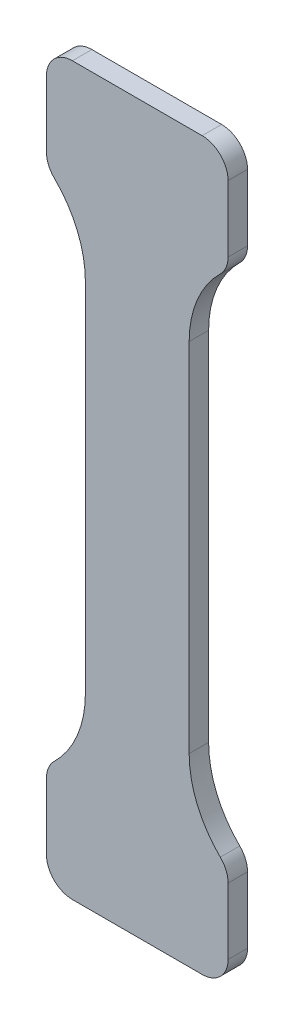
ISO-10303-21;
HEADER;
FILE_DESCRIPTION(('STEP AP214'),'2;1');
FILE_NAME('part.step','',(''),(''),'','','');
FILE_SCHEMA(('AUTOMOTIVE_DESIGN { 1 0 10303 214 1 1 1 1 }'));
ENDSEC;
DATA;
#1=APPLICATION_CONTEXT('core data for automotive mechanical design processes');
#2=APPLICATION_PROTOCOL_DEFINITION('international standard','automotive_design',2000,#1);
#3=PRODUCT_CONTEXT('',#1,'mechanical');
#4=PRODUCT('Part','Part','',(#3));
#5=PRODUCT_RELATED_PRODUCT_CATEGORY('part','',(#4));
#6=PRODUCT_DEFINITION_FORMATION('','',#4);
#7=PRODUCT_DEFINITION_CONTEXT('part definition',#1,'design');
#8=PRODUCT_DEFINITION('design','',#6,#7);
#9=PRODUCT_DEFINITION_SHAPE('','',#8);
#10=(LENGTH_UNIT() NAMED_UNIT(*) SI_UNIT(.MILLI.,.METRE.));
#11=(NAMED_UNIT(*) PLANE_ANGLE_UNIT() SI_UNIT($,.RADIAN.));
#12=(NAMED_UNIT(*) SI_UNIT($,.STERADIAN.) SOLID_ANGLE_UNIT());
#13=UNCERTAINTY_MEASURE_WITH_UNIT(LENGTH_MEASURE(1.E-05),#10,'distance_accuracy_value','');
#14=(GEOMETRIC_REPRESENTATION_CONTEXT(3) GLOBAL_UNCERTAINTY_ASSIGNED_CONTEXT((#13)) GLOBAL_UNIT_ASSIGNED_CONTEXT((#10,
#11,#12)) REPRESENTATION_CONTEXT('',''));
#15=CARTESIAN_POINT('',(0.,0.,0.));
#16=DIRECTION('',(0.,0.,1.));
#17=DIRECTION('',(1.,0.,0.));
#18=AXIS2_PLACEMENT_3D('',#15,#16,#17);
#19=CARTESIAN_POINT('',(-4.,20.,1.5));
#20=DIRECTION('',(1.,0.,0.));
#21=DIRECTION('',(0.,0.,-1.));
#22=AXIS2_PLACEMENT_3D('',#19,#20,#21);
#23=PLANE('',#22);
#24=DIRECTION('',(0.,-1.,0.));
#25=VECTOR('',#24,1.);
#26=CARTESIAN_POINT('',(-4.,20.,1.5));
#27=LINE('',#26,#25);
#28=CARTESIAN_POINT('',(-4.,13.7550020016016,1.5));
#29=VERTEX_POINT('',#28);
#30=CARTESIAN_POINT('',(-4.,-13.7550020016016,1.5));
#31=VERTEX_POINT('',#30);
#32=EDGE_CURVE('E194',#29,#31,#27,.T.);
#33=ORIENTED_EDGE('',*,*,#32,.F.);
#34=DIRECTION('',(0.,0.,-1.));
#35=VECTOR('',#34,1.);
#36=CARTESIAN_POINT('',(-4.,13.7550020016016,1.5));
#37=LINE('',#36,#35);
#38=CARTESIAN_POINT('',(-4.,13.7550020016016,0.));
#39=VERTEX_POINT('',#38);
#40=EDGE_CURVE('E180',#29,#39,#37,.T.);
#41=ORIENTED_EDGE('',*,*,#40,.T.);
#42=DIRECTION('',(0.,-1.,0.));
#43=VECTOR('',#42,1.);
#44=CARTESIAN_POINT('',(-4.,20.,0.));
#45=LINE('',#44,#43);
#46=CARTESIAN_POINT('',(-4.,-13.7550020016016,0.));
#47=VERTEX_POINT('',#46);
#48=EDGE_CURVE('E191',#39,#47,#45,.T.);
#49=ORIENTED_EDGE('',*,*,#48,.T.);
#50=DIRECTION('',(0.,0.,1.));
#51=VECTOR('',#50,1.);
#52=CARTESIAN_POINT('',(-4.,-13.7550020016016,1.5));
#53=LINE('',#52,#51);
#54=EDGE_CURVE('E196',#47,#31,#53,.T.);
#55=ORIENTED_EDGE('',*,*,#54,.T.);
#56=EDGE_LOOP('',(#33,#41,#49,#55));
#57=FACE_BOUND('',#56,.T.);
#58=ADVANCED_FACE('F37',(#57),#23,.F.);
#59=CARTESIAN_POINT('',(-7.,-20.,1.5));
#60=DIRECTION('',(1.,0.,0.));
#61=DIRECTION('',(0.,0.,-1.));
#62=AXIS2_PLACEMENT_3D('',#59,#60,#61);
#63=PLANE('',#62);
#64=DIRECTION('',(0.,-1.,0.));
#65=VECTOR('',#64,1.);
#66=CARTESIAN_POINT('',(-7.,-20.,1.5));
#67=LINE('',#66,#65);
#68=CARTESIAN_POINT('',(-7.,-20.8964304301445,1.5));
#69=VERTEX_POINT('',#68);
#70=CARTESIAN_POINT('',(-7.,-26.,1.5));
#71=VERTEX_POINT('',#70);
#72=EDGE_CURVE('E337',#69,#71,#67,.T.);
#73=ORIENTED_EDGE('',*,*,#72,.F.);
#74=DIRECTION('',(0.,0.,1.));
#75=VECTOR('',#74,1.);
#76=CARTESIAN_POINT('',(-7.,-20.8964304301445,1.5));
#77=LINE('',#76,#75);
#78=CARTESIAN_POINT('',(-7.,-20.8964304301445,0.));
#79=VERTEX_POINT('',#78);
#80=EDGE_CURVE('E289',#69,#79,#77,.F.);
#81=ORIENTED_EDGE('',*,*,#80,.T.);
#82=DIRECTION('',(0.,-1.,0.));
#83=VECTOR('',#82,1.);
#84=CARTESIAN_POINT('',(-7.,-20.,0.));
#85=LINE('',#84,#83);
#86=CARTESIAN_POINT('',(-7.,-26.,0.));
#87=VERTEX_POINT('',#86);
#88=EDGE_CURVE('E202',#79,#87,#85,.T.);
#89=ORIENTED_EDGE('',*,*,#88,.T.);
#90=DIRECTION('',(0.,0.,-1.));
#91=VECTOR('',#90,1.);
#92=CARTESIAN_POINT('',(-7.,-26.,1.5));
#93=LINE('',#92,#91);
#94=EDGE_CURVE('E287',#87,#71,#93,.F.);
#95=ORIENTED_EDGE('',*,*,#94,.T.);
#96=EDGE_LOOP('',(#73,#81,#89,#95));
#97=FACE_BOUND('',#96,.T.);
#98=ADVANCED_FACE('F352',(#97),#63,.F.);
#99=CARTESIAN_POINT('',(-7.,-28.,1.5));
#100=DIRECTION('',(0.,1.,0.));
#101=DIRECTION('',(0.,0.,1.));
#102=AXIS2_PLACEMENT_3D('',#99,#100,#101);
#103=PLANE('',#102);
#104=DIRECTION('',(1.,0.,0.));
#105=VECTOR('',#104,1.);
#106=CARTESIAN_POINT('',(-7.,-28.,1.5));
#107=LINE('',#106,#105);
#108=CARTESIAN_POINT('',(-5.,-28.,1.5));
#109=VERTEX_POINT('',#108);
#110=CARTESIAN_POINT('',(5.,-28.,1.5));
#111=VERTEX_POINT('',#110);
#112=EDGE_CURVE('E334',#109,#111,#107,.T.);
#113=ORIENTED_EDGE('',*,*,#112,.F.);
#114=DIRECTION('',(0.,0.,-1.));
#115=VECTOR('',#114,1.);
#116=CARTESIAN_POINT('',(-5.,-28.,1.5));
#117=LINE('',#116,#115);
#118=CARTESIAN_POINT('',(-5.,-28.,0.));
#119=VERTEX_POINT('',#118);
#120=EDGE_CURVE('E296',#109,#119,#117,.T.);
#121=ORIENTED_EDGE('',*,*,#120,.T.);
#122=DIRECTION('',(1.,0.,0.));
#123=VECTOR('',#122,1.);
#124=CARTESIAN_POINT('',(-7.,-28.,0.));
#125=LINE('',#124,#123);
#126=CARTESIAN_POINT('',(5.,-28.,0.));
#127=VERTEX_POINT('',#126);
#128=EDGE_CURVE('E205',#119,#127,#125,.T.);
#129=ORIENTED_EDGE('',*,*,#128,.T.);
#130=DIRECTION('',(0.,0.,-1.));
#131=VECTOR('',#130,1.);
#132=CARTESIAN_POINT('',(5.,-28.,1.5));
#133=LINE('',#132,#131);
#134=EDGE_CURVE('E294',#127,#111,#133,.F.);
#135=ORIENTED_EDGE('',*,*,#134,.T.);
#136=EDGE_LOOP('',(#113,#121,#129,#135));
#137=FACE_BOUND('',#136,.T.);
#138=ADVANCED_FACE('F361',(#137),#103,.F.);
#139=CARTESIAN_POINT('',(7.,-20.,1.5));
#140=DIRECTION('',(-1.,0.,0.));
#141=DIRECTION('',(0.,-1.,0.));
#142=AXIS2_PLACEMENT_3D('',#139,#140,#141);
#143=PLANE('',#142);
#144=DIRECTION('',(0.,1.,0.));
#145=VECTOR('',#144,1.);
#146=CARTESIAN_POINT('',(7.,-20.,1.5));
#147=LINE('',#146,#145);
#148=CARTESIAN_POINT('',(7.,-26.,1.5));
#149=VERTEX_POINT('',#148);
#150=CARTESIAN_POINT('',(7.,-20.8964304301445,1.5));
#151=VERTEX_POINT('',#150);
#152=EDGE_CURVE('E331',#149,#151,#147,.T.);
#153=ORIENTED_EDGE('',*,*,#152,.F.);
#154=DIRECTION('',(0.,0.,-1.));
#155=VECTOR('',#154,1.);
#156=CARTESIAN_POINT('',(7.,-26.,1.5));
#157=LINE('',#156,#155);
#158=CARTESIAN_POINT('',(7.,-26.,0.));
#159=VERTEX_POINT('',#158);
#160=EDGE_CURVE('E301',#149,#159,#157,.T.);
#161=ORIENTED_EDGE('',*,*,#160,.T.);
#162=DIRECTION('',(0.,1.,0.));
#163=VECTOR('',#162,1.);
#164=CARTESIAN_POINT('',(7.,-20.,0.));
#165=LINE('',#164,#163);
#166=CARTESIAN_POINT('',(7.,-20.8964304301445,0.));
#167=VERTEX_POINT('',#166);
#168=EDGE_CURVE('E213',#159,#167,#165,.T.);
#169=ORIENTED_EDGE('',*,*,#168,.T.);
#170=DIRECTION('',(0.,0.,-1.));
#171=VECTOR('',#170,1.);
#172=CARTESIAN_POINT('',(7.,-20.8964304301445,1.5));
#173=LINE('',#172,#171);
#174=EDGE_CURVE('E299',#167,#151,#173,.F.);
#175=ORIENTED_EDGE('',*,*,#174,.T.);
#176=EDGE_LOOP('',(#153,#161,#169,#175));
#177=FACE_BOUND('',#176,.T.);
#178=ADVANCED_FACE('F370',(#177),#143,.F.);
#179=CARTESIAN_POINT('',(4.,20.,1.5));
#180=DIRECTION('',(-1.,0.,0.));
#181=DIRECTION('',(0.,-1.,0.));
#182=AXIS2_PLACEMENT_3D('',#179,#180,#181);
#183=PLANE('',#182);
#184=DIRECTION('',(0.,1.,0.));
#185=VECTOR('',#184,1.);
#186=CARTESIAN_POINT('',(4.,20.,0.));
#187=LINE('',#186,#185);
#188=CARTESIAN_POINT('',(4.,-13.7550020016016,0.));
#189=VERTEX_POINT('',#188);
#190=CARTESIAN_POINT('',(4.,13.7550020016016,0.));
#191=VERTEX_POINT('',#190);
#192=EDGE_CURVE('E216',#189,#191,#187,.T.);
#193=ORIENTED_EDGE('',*,*,#192,.T.);
#194=DIRECTION('',(0.,0.,1.));
#195=VECTOR('',#194,1.);
#196=CARTESIAN_POINT('',(4.,13.7550020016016,1.5));
#197=LINE('',#196,#195);
#198=CARTESIAN_POINT('',(4.,13.7550020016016,1.5));
#199=VERTEX_POINT('',#198);
#200=EDGE_CURVE('E186',#191,#199,#197,.T.);
#201=ORIENTED_EDGE('',*,*,#200,.T.);
#202=DIRECTION('',(0.,1.,0.));
#203=VECTOR('',#202,1.);
#204=CARTESIAN_POINT('',(4.,20.,1.5));
#205=LINE('',#204,#203);
#206=CARTESIAN_POINT('',(4.,-13.7550020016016,1.5));
#207=VERTEX_POINT('',#206);
#208=EDGE_CURVE('E326',#207,#199,#205,.T.);
#209=ORIENTED_EDGE('',*,*,#208,.F.);
#210=DIRECTION('',(0.,0.,-1.));
#211=VECTOR('',#210,1.);
#212=CARTESIAN_POINT('',(4.,-13.7550020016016,1.5));
#213=LINE('',#212,#211);
#214=EDGE_CURVE('E195',#207,#189,#213,.T.);
#215=ORIENTED_EDGE('',*,*,#214,.T.);
#216=EDGE_LOOP('',(#193,#201,#209,#215));
#217=FACE_BOUND('',#216,.T.);
#218=ADVANCED_FACE('F383',(#217),#183,.F.);
#219=CARTESIAN_POINT('',(7.,28.,1.5));
#220=DIRECTION('',(-1.,0.,0.));
#221=DIRECTION('',(0.,-1.,0.));
#222=AXIS2_PLACEMENT_3D('',#219,#220,#221);
#223=PLANE('',#222);
#224=DIRECTION('',(0.,1.,0.));
#225=VECTOR('',#224,1.);
#226=CARTESIAN_POINT('',(7.,28.,1.5));
#227=LINE('',#226,#225);
#228=CARTESIAN_POINT('',(7.,20.8964304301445,1.5));
#229=VERTEX_POINT('',#228);
#230=CARTESIAN_POINT('',(7.,26.,1.5));
#231=VERTEX_POINT('',#230);
#232=EDGE_CURVE('E311',#229,#231,#227,.T.);
#233=ORIENTED_EDGE('',*,*,#232,.F.);
#234=DIRECTION('',(0.,0.,1.));
#235=VECTOR('',#234,1.);
#236=CARTESIAN_POINT('',(7.,20.8964304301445,1.5));
#237=LINE('',#236,#235);
#238=CARTESIAN_POINT('',(7.,20.8964304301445,0.));
#239=VERTEX_POINT('',#238);
#240=EDGE_CURVE('E45',#229,#239,#237,.F.);
#241=ORIENTED_EDGE('',*,*,#240,.T.);
#242=DIRECTION('',(0.,1.,0.));
#243=VECTOR('',#242,1.);
#244=CARTESIAN_POINT('',(7.,28.,0.));
#245=LINE('',#244,#243);
#246=CARTESIAN_POINT('',(7.,26.,0.));
#247=VERTEX_POINT('',#246);
#248=EDGE_CURVE('E219',#239,#247,#245,.T.);
#249=ORIENTED_EDGE('',*,*,#248,.T.);
#250=DIRECTION('',(0.,0.,-1.));
#251=VECTOR('',#250,1.);
#252=CARTESIAN_POINT('',(7.,26.,1.5));
#253=LINE('',#252,#251);
#254=EDGE_CURVE('E52',#247,#231,#253,.F.);
#255=ORIENTED_EDGE('',*,*,#254,.T.);
#256=EDGE_LOOP('',(#233,#241,#249,#255));
#257=FACE_BOUND('',#256,.T.);
#258=ADVANCED_FACE('F310',(#257),#223,.F.);
#259=CARTESIAN_POINT('',(-7.,28.,1.5));
#260=DIRECTION('',(0.,-1.,0.));
#261=DIRECTION('',(1.,0.,0.));
#262=AXIS2_PLACEMENT_3D('',#259,#260,#261);
#263=PLANE('',#262);
#264=DIRECTION('',(-1.,0.,0.));
#265=VECTOR('',#264,1.);
#266=CARTESIAN_POINT('',(-7.,28.,0.));
#267=LINE('',#266,#265);
#268=CARTESIAN_POINT('',(5.,28.,0.));
#269=VERTEX_POINT('',#268);
#270=CARTESIAN_POINT('',(-5.,28.,0.));
#271=VERTEX_POINT('',#270);
#272=EDGE_CURVE('E221',#269,#271,#267,.T.);
#273=ORIENTED_EDGE('',*,*,#272,.T.);
#274=DIRECTION('',(0.,0.,-1.));
#275=VECTOR('',#274,1.);
#276=CARTESIAN_POINT('',(-5.,28.,1.5));
#277=LINE('',#276,#275);
#278=CARTESIAN_POINT('',(-5.,28.,1.5));
#279=VERTEX_POINT('',#278);
#280=EDGE_CURVE('E269',#271,#279,#277,.F.);
#281=ORIENTED_EDGE('',*,*,#280,.T.);
#282=DIRECTION('',(-1.,0.,0.));
#283=VECTOR('',#282,1.);
#284=CARTESIAN_POINT('',(-7.,28.,1.5));
#285=LINE('',#284,#283);
#286=CARTESIAN_POINT('',(5.,28.,1.5));
#287=VERTEX_POINT('',#286);
#288=EDGE_CURVE('E323',#287,#279,#285,.T.);
#289=ORIENTED_EDGE('',*,*,#288,.F.);
#290=DIRECTION('',(0.,0.,-1.));
#291=VECTOR('',#290,1.);
#292=CARTESIAN_POINT('',(5.,28.,1.5));
#293=LINE('',#292,#291);
#294=EDGE_CURVE('E266',#287,#269,#293,.T.);
#295=ORIENTED_EDGE('',*,*,#294,.T.);
#296=EDGE_LOOP('',(#273,#281,#289,#295));
#297=FACE_BOUND('',#296,.T.);
#298=ADVANCED_FACE('F320',(#297),#263,.F.);
#299=CARTESIAN_POINT('',(-7.,28.,1.5));
#300=DIRECTION('',(1.,0.,0.));
#301=DIRECTION('',(0.,0.,-1.));
#302=AXIS2_PLACEMENT_3D('',#299,#300,#301);
#303=PLANE('',#302);
#304=DIRECTION('',(0.,-1.,0.));
#305=VECTOR('',#304,1.);
#306=CARTESIAN_POINT('',(-7.,28.,1.5));
#307=LINE('',#306,#305);
#308=CARTESIAN_POINT('',(-7.,26.,1.5));
#309=VERTEX_POINT('',#308);
#310=CARTESIAN_POINT('',(-7.,20.8964304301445,1.5));
#311=VERTEX_POINT('',#310);
#312=EDGE_CURVE('E208',#309,#311,#307,.T.);
#313=ORIENTED_EDGE('',*,*,#312,.F.);
#314=DIRECTION('',(0.,0.,-1.));
#315=VECTOR('',#314,1.);
#316=CARTESIAN_POINT('',(-7.,26.,1.5));
#317=LINE('',#316,#315);
#318=CARTESIAN_POINT('',(-7.,26.,0.));
#319=VERTEX_POINT('',#318);
#320=EDGE_CURVE('E247',#309,#319,#317,.T.);
#321=ORIENTED_EDGE('',*,*,#320,.T.);
#322=DIRECTION('',(0.,-1.,0.));
#323=VECTOR('',#322,1.);
#324=CARTESIAN_POINT('',(-7.,28.,0.));
#325=LINE('',#324,#323);
#326=CARTESIAN_POINT('',(-7.,20.8964304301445,0.));
#327=VERTEX_POINT('',#326);
#328=EDGE_CURVE('E224',#319,#327,#325,.T.);
#329=ORIENTED_EDGE('',*,*,#328,.T.);
#330=DIRECTION('',(0.,0.,-1.));
#331=VECTOR('',#330,1.);
#332=CARTESIAN_POINT('',(-7.,20.8964304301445,1.5));
#333=LINE('',#332,#331);
#334=EDGE_CURVE('E245',#327,#311,#333,.F.);
#335=ORIENTED_EDGE('',*,*,#334,.T.);
#336=EDGE_LOOP('',(#313,#321,#329,#335));
#337=FACE_BOUND('',#336,.T.);
#338=ADVANCED_FACE('F501',(#337),#303,.F.);
#339=CARTESIAN_POINT('',(0.,0.,1.5));
#340=DIRECTION('',(0.,0.,-1.));
#341=DIRECTION('',(-1.,0.,0.));
#342=AXIS2_PLACEMENT_3D('',#339,#340,#341);
#343=PLANE('',#342);
#344=ORIENTED_EDGE('',*,*,#288,.T.);
#345=CARTESIAN_POINT('',(-5.,26.,1.5));
#346=DIRECTION('',(0.,0.,-1.));
#347=DIRECTION('',(-1.,0.,0.));
#348=AXIS2_PLACEMENT_3D('',#345,#346,#347);
#349=CIRCLE('',#348,2.);
#350=EDGE_CURVE('E284',#279,#309,#349,.F.);
#351=ORIENTED_EDGE('',*,*,#350,.T.);
#352=ORIENTED_EDGE('',*,*,#312,.T.);
#353=CARTESIAN_POINT('',(-5.,20.8964304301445,1.5));
#354=DIRECTION('',(0.,0.,-1.));
#355=DIRECTION('',(-1.,0.,0.));
#356=AXIS2_PLACEMENT_3D('',#353,#354,#355);
#357=CIRCLE('',#356,2.);
#358=CARTESIAN_POINT('',(-6.4,19.4681447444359,1.5));
#359=VERTEX_POINT('',#358);
#360=EDGE_CURVE('E282',#311,#359,#357,.F.);
#361=ORIENTED_EDGE('',*,*,#360,.T.);
#362=CARTESIAN_POINT('',(-12.,13.7550020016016,1.5));
#363=DIRECTION('',(0.,0.,-1.));
#364=DIRECTION('',(-1.,0.,0.));
#365=AXIS2_PLACEMENT_3D('',#362,#363,#364);
#366=CIRCLE('',#365,8.);
#367=EDGE_CURVE('E185',#359,#29,#366,.T.);
#368=ORIENTED_EDGE('',*,*,#367,.T.);
#369=ORIENTED_EDGE('',*,*,#32,.T.);
#370=CARTESIAN_POINT('',(-12.,-13.7550020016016,1.5));
#371=DIRECTION('',(0.,0.,-1.));
#372=DIRECTION('',(-1.,0.,0.));
#373=AXIS2_PLACEMENT_3D('',#370,#371,#372);
#374=CIRCLE('',#373,8.);
#375=CARTESIAN_POINT('',(-6.4,-19.4681447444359,1.5));
#376=VERTEX_POINT('',#375);
#377=EDGE_CURVE('E242',#31,#376,#374,.T.);
#378=ORIENTED_EDGE('',*,*,#377,.T.);
#379=CARTESIAN_POINT('',(-5.,-20.8964304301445,1.5));
#380=DIRECTION('',(0.,0.,-1.));
#381=DIRECTION('',(-1.,0.,0.));
#382=AXIS2_PLACEMENT_3D('',#379,#380,#381);
#383=CIRCLE('',#382,2.);
#384=EDGE_CURVE('E280',#376,#69,#383,.F.);
#385=ORIENTED_EDGE('',*,*,#384,.T.);
#386=ORIENTED_EDGE('',*,*,#72,.T.);
#387=CARTESIAN_POINT('',(-5.,-26.,1.5));
#388=DIRECTION('',(0.,0.,-1.));
#389=DIRECTION('',(-1.,0.,0.));
#390=AXIS2_PLACEMENT_3D('',#387,#388,#389);
#391=CIRCLE('',#390,2.);
#392=EDGE_CURVE('E278',#71,#109,#391,.F.);
#393=ORIENTED_EDGE('',*,*,#392,.T.);
#394=ORIENTED_EDGE('',*,*,#112,.T.);
#395=CARTESIAN_POINT('',(5.,-26.,1.5));
#396=DIRECTION('',(0.,0.,-1.));
#397=DIRECTION('',(-1.,0.,0.));
#398=AXIS2_PLACEMENT_3D('',#395,#396,#397);
#399=CIRCLE('',#398,2.);
#400=EDGE_CURVE('E276',#111,#149,#399,.F.);
#401=ORIENTED_EDGE('',*,*,#400,.T.);
#402=ORIENTED_EDGE('',*,*,#152,.T.);
#403=CARTESIAN_POINT('',(5.,-20.8964304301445,1.5));
#404=DIRECTION('',(0.,0.,-1.));
#405=DIRECTION('',(-1.,0.,0.));
#406=AXIS2_PLACEMENT_3D('',#403,#404,#405);
#407=CIRCLE('',#406,2.);
#408=CARTESIAN_POINT('',(6.4,-19.4681447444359,1.5));
#409=VERTEX_POINT('',#408);
#410=EDGE_CURVE('E274',#151,#409,#407,.F.);
#411=ORIENTED_EDGE('',*,*,#410,.T.);
#412=CARTESIAN_POINT('',(12.,-13.7550020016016,1.5));
#413=DIRECTION('',(0.,0.,-1.));
#414=DIRECTION('',(-1.,0.,0.));
#415=AXIS2_PLACEMENT_3D('',#412,#413,#414);
#416=CIRCLE('',#415,8.);
#417=EDGE_CURVE('E239',#409,#207,#416,.T.);
#418=ORIENTED_EDGE('',*,*,#417,.T.);
#419=ORIENTED_EDGE('',*,*,#208,.T.);
#420=CARTESIAN_POINT('',(12.,13.7550020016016,1.5));
#421=DIRECTION('',(0.,0.,-1.));
#422=DIRECTION('',(-1.,0.,0.));
#423=AXIS2_PLACEMENT_3D('',#420,#421,#422);
#424=CIRCLE('',#423,8.);
#425=CARTESIAN_POINT('',(6.4,19.4681447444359,1.5));
#426=VERTEX_POINT('',#425);
#427=EDGE_CURVE('E234',#199,#426,#424,.T.);
#428=ORIENTED_EDGE('',*,*,#427,.T.);
#429=CARTESIAN_POINT('',(5.,20.8964304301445,1.5));
#430=DIRECTION('',(0.,0.,-1.));
#431=DIRECTION('',(-1.,0.,0.));
#432=AXIS2_PLACEMENT_3D('',#429,#430,#431);
#433=CIRCLE('',#432,2.);
#434=EDGE_CURVE('E59',#426,#229,#433,.F.);
#435=ORIENTED_EDGE('',*,*,#434,.T.);
#436=ORIENTED_EDGE('',*,*,#232,.T.);
#437=CARTESIAN_POINT('',(5.,26.,1.5));
#438=DIRECTION('',(0.,0.,-1.));
#439=DIRECTION('',(-1.,0.,0.));
#440=AXIS2_PLACEMENT_3D('',#437,#438,#439);
#441=CIRCLE('',#440,2.);
#442=EDGE_CURVE('E271',#231,#287,#441,.F.);
#443=ORIENTED_EDGE('',*,*,#442,.T.);
#444=EDGE_LOOP('',(#344,#351,#352,#361,#368,#369,#378,#385,#386,#393,#394,#401,#402,#411,#418,
#419,#428,#435,#436,#443));
#445=FACE_BOUND('',#444,.T.);
#446=ADVANCED_FACE('F341',(#445),#343,.F.);
#447=CARTESIAN_POINT('',(0.,0.,0.));
#448=DIRECTION('',(0.,0.,-1.));
#449=DIRECTION('',(-1.,0.,0.));
#450=AXIS2_PLACEMENT_3D('',#447,#448,#449);
#451=PLANE('',#450);
#452=ORIENTED_EDGE('',*,*,#328,.F.);
#453=CARTESIAN_POINT('',(-5.,26.,0.));
#454=DIRECTION('',(0.,0.,-1.));
#455=DIRECTION('',(-1.,0.,0.));
#456=AXIS2_PLACEMENT_3D('',#453,#454,#455);
#457=CIRCLE('',#456,2.);
#458=EDGE_CURVE('E264',#319,#271,#457,.T.);
#459=ORIENTED_EDGE('',*,*,#458,.T.);
#460=ORIENTED_EDGE('',*,*,#272,.F.);
#461=CARTESIAN_POINT('',(5.,26.,0.));
#462=DIRECTION('',(0.,0.,-1.));
#463=DIRECTION('',(-1.,0.,0.));
#464=AXIS2_PLACEMENT_3D('',#461,#462,#463);
#465=CIRCLE('',#464,2.);
#466=EDGE_CURVE('E250',#269,#247,#465,.T.);
#467=ORIENTED_EDGE('',*,*,#466,.T.);
#468=ORIENTED_EDGE('',*,*,#248,.F.);
#469=CARTESIAN_POINT('',(5.,20.8964304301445,0.));
#470=DIRECTION('',(0.,0.,-1.));
#471=DIRECTION('',(-1.,0.,0.));
#472=AXIS2_PLACEMENT_3D('',#469,#470,#471);
#473=CIRCLE('',#472,2.);
#474=CARTESIAN_POINT('',(6.4,19.4681447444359,0.));
#475=VERTEX_POINT('',#474);
#476=EDGE_CURVE('E252',#239,#475,#473,.T.);
#477=ORIENTED_EDGE('',*,*,#476,.T.);
#478=CARTESIAN_POINT('',(12.,13.7550020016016,0.));
#479=DIRECTION('',(0.,0.,-1.));
#480=DIRECTION('',(-1.,0.,0.));
#481=AXIS2_PLACEMENT_3D('',#478,#479,#480);
#482=CIRCLE('',#481,8.);
#483=EDGE_CURVE('E232',#475,#191,#482,.F.);
#484=ORIENTED_EDGE('',*,*,#483,.T.);
#485=ORIENTED_EDGE('',*,*,#192,.F.);
#486=CARTESIAN_POINT('',(12.,-13.7550020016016,0.));
#487=DIRECTION('',(0.,0.,-1.));
#488=DIRECTION('',(-1.,0.,0.));
#489=AXIS2_PLACEMENT_3D('',#486,#487,#488);
#490=CIRCLE('',#489,8.);
#491=CARTESIAN_POINT('',(6.4,-19.4681447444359,0.));
#492=VERTEX_POINT('',#491);
#493=EDGE_CURVE('E236',#189,#492,#490,.F.);
#494=ORIENTED_EDGE('',*,*,#493,.T.);
#495=CARTESIAN_POINT('',(5.,-20.8964304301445,0.));
#496=DIRECTION('',(0.,0.,-1.));
#497=DIRECTION('',(-1.,0.,0.));
#498=AXIS2_PLACEMENT_3D('',#495,#496,#497);
#499=CIRCLE('',#498,2.);
#500=EDGE_CURVE('E254',#492,#167,#499,.T.);
#501=ORIENTED_EDGE('',*,*,#500,.T.);
#502=ORIENTED_EDGE('',*,*,#168,.F.);
#503=CARTESIAN_POINT('',(5.,-26.,0.));
#504=DIRECTION('',(0.,0.,-1.));
#505=DIRECTION('',(-1.,0.,0.));
#506=AXIS2_PLACEMENT_3D('',#503,#504,#505);
#507=CIRCLE('',#506,2.);
#508=EDGE_CURVE('E256',#159,#127,#507,.T.);
#509=ORIENTED_EDGE('',*,*,#508,.T.);
#510=ORIENTED_EDGE('',*,*,#128,.F.);
#511=CARTESIAN_POINT('',(-5.,-26.,0.));
#512=DIRECTION('',(0.,0.,-1.));
#513=DIRECTION('',(-1.,0.,0.));
#514=AXIS2_PLACEMENT_3D('',#511,#512,#513);
#515=CIRCLE('',#514,2.);
#516=EDGE_CURVE('E258',#119,#87,#515,.T.);
#517=ORIENTED_EDGE('',*,*,#516,.T.);
#518=ORIENTED_EDGE('',*,*,#88,.F.);
#519=CARTESIAN_POINT('',(-5.,-20.8964304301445,0.));
#520=DIRECTION('',(0.,0.,-1.));
#521=DIRECTION('',(-1.,0.,0.));
#522=AXIS2_PLACEMENT_3D('',#519,#520,#521);
#523=CIRCLE('',#522,2.);
#524=CARTESIAN_POINT('',(-6.4,-19.4681447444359,0.));
#525=VERTEX_POINT('',#524);
#526=EDGE_CURVE('E260',#79,#525,#523,.T.);
#527=ORIENTED_EDGE('',*,*,#526,.T.);
#528=CARTESIAN_POINT('',(-12.,-13.7550020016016,0.));
#529=DIRECTION('',(0.,0.,-1.));
#530=DIRECTION('',(-1.,0.,0.));
#531=AXIS2_PLACEMENT_3D('',#528,#529,#530);
#532=CIRCLE('',#531,8.);
#533=EDGE_CURVE('E201',#525,#47,#532,.F.);
#534=ORIENTED_EDGE('',*,*,#533,.T.);
#535=ORIENTED_EDGE('',*,*,#48,.F.);
#536=CARTESIAN_POINT('',(-12.,13.7550020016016,0.));
#537=DIRECTION('',(0.,0.,-1.));
#538=DIRECTION('',(-1.,0.,0.));
#539=AXIS2_PLACEMENT_3D('',#536,#537,#538);
#540=CIRCLE('',#539,8.);
#541=CARTESIAN_POINT('',(-6.4,19.4681447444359,0.));
#542=VERTEX_POINT('',#541);
#543=EDGE_CURVE('E176',#39,#542,#540,.F.);
#544=ORIENTED_EDGE('',*,*,#543,.T.);
#545=CARTESIAN_POINT('',(-5.,20.8964304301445,0.));
#546=DIRECTION('',(0.,0.,-1.));
#547=DIRECTION('',(-1.,0.,0.));
#548=AXIS2_PLACEMENT_3D('',#545,#546,#547);
#549=CIRCLE('',#548,2.);
#550=EDGE_CURVE('E262',#542,#327,#549,.T.);
#551=ORIENTED_EDGE('',*,*,#550,.T.);
#552=EDGE_LOOP('',(#452,#459,#460,#467,#468,#477,#484,#485,#494,#501,#502,#509,#510,#517,#518,
#527,#534,#535,#544,#551));
#553=FACE_BOUND('',#552,.T.);
#554=ADVANCED_FACE('F199',(#553),#451,.T.);
#555=CARTESIAN_POINT('',(-12.,13.7550020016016,1.5));
#556=DIRECTION('',(0.,0.,-1.));
#557=DIRECTION('',(-1.,0.,0.));
#558=AXIS2_PLACEMENT_3D('',#555,#556,#557);
#559=CYLINDRICAL_SURFACE('',#558,8.);
#560=ORIENTED_EDGE('',*,*,#367,.F.);
#561=DIRECTION('',(0.,0.,-1.));
#562=VECTOR('',#561,1.);
#563=CARTESIAN_POINT('',(-6.4,19.4681447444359,1.5));
#564=LINE('',#563,#562);
#565=EDGE_CURVE('E182',#359,#542,#564,.T.);
#566=ORIENTED_EDGE('',*,*,#565,.T.);
#567=ORIENTED_EDGE('',*,*,#543,.F.);
#568=ORIENTED_EDGE('',*,*,#40,.F.);
#569=EDGE_LOOP('',(#560,#566,#567,#568));
#570=FACE_BOUND('',#569,.T.);
#571=ADVANCED_FACE('F179',(#570),#559,.F.);
#572=CARTESIAN_POINT('',(12.,13.7550020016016,1.5));
#573=DIRECTION('',(0.,0.,1.));
#574=DIRECTION('',(1.,0.,0.));
#575=AXIS2_PLACEMENT_3D('',#572,#573,#574);
#576=CYLINDRICAL_SURFACE('',#575,8.);
#577=ORIENTED_EDGE('',*,*,#483,.F.);
#578=DIRECTION('',(0.,0.,1.));
#579=VECTOR('',#578,1.);
#580=CARTESIAN_POINT('',(6.4,19.4681447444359,1.5));
#581=LINE('',#580,#579);
#582=EDGE_CURVE('E11',#475,#426,#581,.T.);
#583=ORIENTED_EDGE('',*,*,#582,.T.);
#584=ORIENTED_EDGE('',*,*,#427,.F.);
#585=ORIENTED_EDGE('',*,*,#200,.F.);
#586=EDGE_LOOP('',(#577,#583,#584,#585));
#587=FACE_BOUND('',#586,.T.);
#588=ADVANCED_FACE('F387',(#587),#576,.F.);
#589=CARTESIAN_POINT('',(12.,-13.7550020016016,1.5));
#590=DIRECTION('',(0.,0.,-1.));
#591=DIRECTION('',(-1.,0.,0.));
#592=AXIS2_PLACEMENT_3D('',#589,#590,#591);
#593=CYLINDRICAL_SURFACE('',#592,8.);
#594=ORIENTED_EDGE('',*,*,#417,.F.);
#595=DIRECTION('',(0.,0.,-1.));
#596=VECTOR('',#595,1.);
#597=CARTESIAN_POINT('',(6.4,-19.4681447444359,1.5));
#598=LINE('',#597,#596);
#599=EDGE_CURVE('E304',#409,#492,#598,.T.);
#600=ORIENTED_EDGE('',*,*,#599,.T.);
#601=ORIENTED_EDGE('',*,*,#493,.F.);
#602=ORIENTED_EDGE('',*,*,#214,.F.);
#603=EDGE_LOOP('',(#594,#600,#601,#602));
#604=FACE_BOUND('',#603,.T.);
#605=ADVANCED_FACE('F380',(#604),#593,.F.);
#606=CARTESIAN_POINT('',(-12.,-13.7550020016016,1.5));
#607=DIRECTION('',(0.,0.,1.));
#608=DIRECTION('',(1.,0.,0.));
#609=AXIS2_PLACEMENT_3D('',#606,#607,#608);
#610=CYLINDRICAL_SURFACE('',#609,8.);
#611=ORIENTED_EDGE('',*,*,#533,.F.);
#612=DIRECTION('',(0.,0.,1.));
#613=VECTOR('',#612,1.);
#614=CARTESIAN_POINT('',(-6.4,-19.4681447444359,1.5));
#615=LINE('',#614,#613);
#616=EDGE_CURVE('E292',#525,#376,#615,.T.);
#617=ORIENTED_EDGE('',*,*,#616,.T.);
#618=ORIENTED_EDGE('',*,*,#377,.F.);
#619=ORIENTED_EDGE('',*,*,#54,.F.);
#620=EDGE_LOOP('',(#611,#617,#618,#619));
#621=FACE_BOUND('',#620,.T.);
#622=ADVANCED_FACE('F344',(#621),#610,.F.);
#623=CARTESIAN_POINT('',(-5.,26.,1.5));
#624=DIRECTION('',(0.,0.,-1.));
#625=DIRECTION('',(-1.,0.,0.));
#626=AXIS2_PLACEMENT_3D('',#623,#624,#625);
#627=CYLINDRICAL_SURFACE('',#626,2.);
#628=ORIENTED_EDGE('',*,*,#350,.F.);
#629=ORIENTED_EDGE('',*,*,#280,.F.);
#630=ORIENTED_EDGE('',*,*,#458,.F.);
#631=ORIENTED_EDGE('',*,*,#320,.F.);
#632=EDGE_LOOP('',(#628,#629,#630,#631));
#633=FACE_BOUND('',#632,.T.);
#634=ADVANCED_FACE('F412',(#633),#627,.T.);
#635=CARTESIAN_POINT('',(-5.,20.8964304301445,1.5));
#636=DIRECTION('',(0.,0.,-1.));
#637=DIRECTION('',(-1.,0.,0.));
#638=AXIS2_PLACEMENT_3D('',#635,#636,#637);
#639=CYLINDRICAL_SURFACE('',#638,2.);
#640=ORIENTED_EDGE('',*,*,#360,.F.);
#641=ORIENTED_EDGE('',*,*,#334,.F.);
#642=ORIENTED_EDGE('',*,*,#550,.F.);
#643=ORIENTED_EDGE('',*,*,#565,.F.);
#644=EDGE_LOOP('',(#640,#641,#642,#643));
#645=FACE_BOUND('',#644,.T.);
#646=ADVANCED_FACE('F415',(#645),#639,.T.);
#647=CARTESIAN_POINT('',(-5.,-20.8964304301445,1.5));
#648=DIRECTION('',(0.,0.,1.));
#649=DIRECTION('',(1.,0.,0.));
#650=AXIS2_PLACEMENT_3D('',#647,#648,#649);
#651=CYLINDRICAL_SURFACE('',#650,2.);
#652=ORIENTED_EDGE('',*,*,#384,.F.);
#653=ORIENTED_EDGE('',*,*,#616,.F.);
#654=ORIENTED_EDGE('',*,*,#526,.F.);
#655=ORIENTED_EDGE('',*,*,#80,.F.);
#656=EDGE_LOOP('',(#652,#653,#654,#655));
#657=FACE_BOUND('',#656,.T.);
#658=ADVANCED_FACE('F347',(#657),#651,.T.);
#659=CARTESIAN_POINT('',(-5.,-26.,1.5));
#660=DIRECTION('',(0.,0.,-1.));
#661=DIRECTION('',(-1.,0.,0.));
#662=AXIS2_PLACEMENT_3D('',#659,#660,#661);
#663=CYLINDRICAL_SURFACE('',#662,2.);
#664=ORIENTED_EDGE('',*,*,#392,.F.);
#665=ORIENTED_EDGE('',*,*,#94,.F.);
#666=ORIENTED_EDGE('',*,*,#516,.F.);
#667=ORIENTED_EDGE('',*,*,#120,.F.);
#668=EDGE_LOOP('',(#664,#665,#666,#667));
#669=FACE_BOUND('',#668,.T.);
#670=ADVANCED_FACE('F356',(#669),#663,.T.);
#671=CARTESIAN_POINT('',(5.,-26.,1.5));
#672=DIRECTION('',(0.,0.,-1.));
#673=DIRECTION('',(-1.,0.,0.));
#674=AXIS2_PLACEMENT_3D('',#671,#672,#673);
#675=CYLINDRICAL_SURFACE('',#674,2.);
#676=ORIENTED_EDGE('',*,*,#400,.F.);
#677=ORIENTED_EDGE('',*,*,#134,.F.);
#678=ORIENTED_EDGE('',*,*,#508,.F.);
#679=ORIENTED_EDGE('',*,*,#160,.F.);
#680=EDGE_LOOP('',(#676,#677,#678,#679));
#681=FACE_BOUND('',#680,.T.);
#682=ADVANCED_FACE('F365',(#681),#675,.T.);
#683=CARTESIAN_POINT('',(5.,-20.8964304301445,1.5));
#684=DIRECTION('',(0.,0.,-1.));
#685=DIRECTION('',(-1.,0.,0.));
#686=AXIS2_PLACEMENT_3D('',#683,#684,#685);
#687=CYLINDRICAL_SURFACE('',#686,2.);
#688=ORIENTED_EDGE('',*,*,#410,.F.);
#689=ORIENTED_EDGE('',*,*,#174,.F.);
#690=ORIENTED_EDGE('',*,*,#500,.F.);
#691=ORIENTED_EDGE('',*,*,#599,.F.);
#692=EDGE_LOOP('',(#688,#689,#690,#691));
#693=FACE_BOUND('',#692,.T.);
#694=ADVANCED_FACE('F374',(#693),#687,.T.);
#695=CARTESIAN_POINT('',(5.,20.8964304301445,1.5));
#696=DIRECTION('',(0.,0.,1.));
#697=DIRECTION('',(1.,0.,0.));
#698=AXIS2_PLACEMENT_3D('',#695,#696,#697);
#699=CYLINDRICAL_SURFACE('',#698,2.);
#700=ORIENTED_EDGE('',*,*,#434,.F.);
#701=ORIENTED_EDGE('',*,*,#582,.F.);
#702=ORIENTED_EDGE('',*,*,#476,.F.);
#703=ORIENTED_EDGE('',*,*,#240,.F.);
#704=EDGE_LOOP('',(#700,#701,#702,#703));
#705=FACE_BOUND('',#704,.T.);
#706=ADVANCED_FACE('F389',(#705),#699,.T.);
#707=CARTESIAN_POINT('',(5.,26.,1.5));
#708=DIRECTION('',(0.,0.,-1.));
#709=DIRECTION('',(-1.,0.,0.));
#710=AXIS2_PLACEMENT_3D('',#707,#708,#709);
#711=CYLINDRICAL_SURFACE('',#710,2.);
#712=ORIENTED_EDGE('',*,*,#442,.F.);
#713=ORIENTED_EDGE('',*,*,#254,.F.);
#714=ORIENTED_EDGE('',*,*,#466,.F.);
#715=ORIENTED_EDGE('',*,*,#294,.F.);
#716=EDGE_LOOP('',(#712,#713,#714,#715));
#717=FACE_BOUND('',#716,.T.);
#718=ADVANCED_FACE('F39',(#717),#711,.T.);
#719=CLOSED_SHELL('',(#58,#98,#138,#178,#218,#258,#298,#338,#446,#554,#571,#588,#605,#622,#634,
#646,#658,#670,#682,#694,#706,#718));
#720=MANIFOLD_SOLID_BREP('B2',#719);
#721=ADVANCED_BREP_SHAPE_REPRESENTATION('',(#18,#720),#14);
#722=SHAPE_DEFINITION_REPRESENTATION(#9,#721);
ENDSEC;
END-ISO-10303-21;
